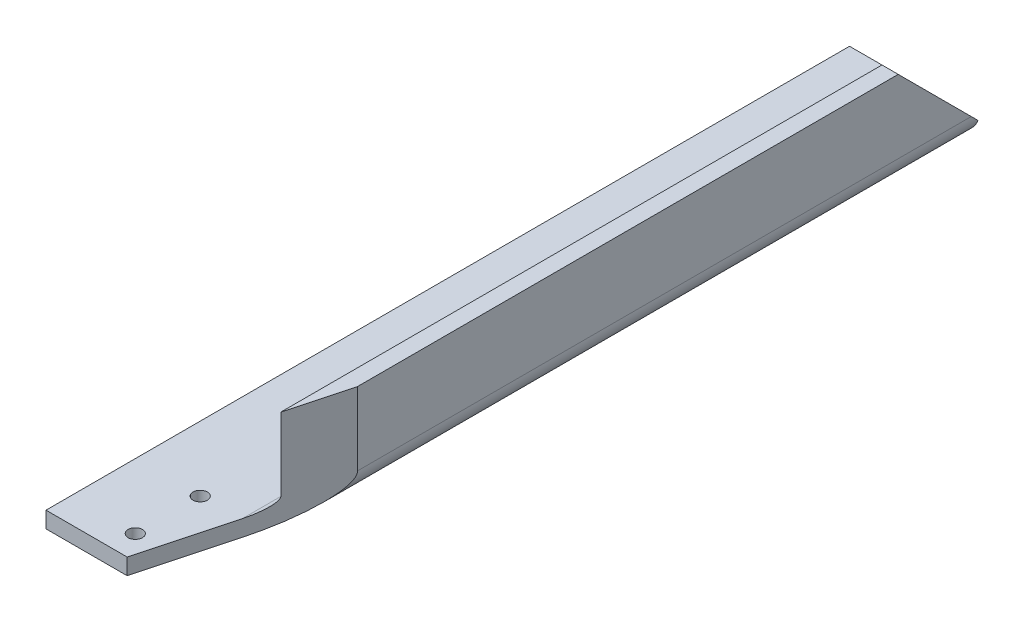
ISO-10303-21;
HEADER;
FILE_DESCRIPTION(('STEP AP214'),'2;1');
FILE_NAME('part.step','',(''),(''),'','','');
FILE_SCHEMA(('AUTOMOTIVE_DESIGN { 1 0 10303 214 1 1 1 1 }'));
ENDSEC;
DATA;
#1=APPLICATION_CONTEXT('core data for automotive mechanical design processes');
#2=APPLICATION_PROTOCOL_DEFINITION('international standard','automotive_design',2000,#1);
#3=PRODUCT_CONTEXT('',#1,'mechanical');
#4=PRODUCT('Part','Part','',(#3));
#5=PRODUCT_RELATED_PRODUCT_CATEGORY('part','',(#4));
#6=PRODUCT_DEFINITION_FORMATION('','',#4);
#7=PRODUCT_DEFINITION_CONTEXT('part definition',#1,'design');
#8=PRODUCT_DEFINITION('design','',#6,#7);
#9=PRODUCT_DEFINITION_SHAPE('','',#8);
#10=(LENGTH_UNIT() NAMED_UNIT(*) SI_UNIT(.MILLI.,.METRE.));
#11=(NAMED_UNIT(*) PLANE_ANGLE_UNIT() SI_UNIT($,.RADIAN.));
#12=(NAMED_UNIT(*) SI_UNIT($,.STERADIAN.) SOLID_ANGLE_UNIT());
#13=UNCERTAINTY_MEASURE_WITH_UNIT(LENGTH_MEASURE(1.E-05),#10,'distance_accuracy_value','');
#14=(GEOMETRIC_REPRESENTATION_CONTEXT(3) GLOBAL_UNCERTAINTY_ASSIGNED_CONTEXT((#13)) GLOBAL_UNIT_ASSIGNED_CONTEXT((#10,
#11,#12)) REPRESENTATION_CONTEXT('',''));
#15=CARTESIAN_POINT('',(0.,0.,0.));
#16=DIRECTION('',(0.,0.,1.));
#17=DIRECTION('',(1.,0.,0.));
#18=AXIS2_PLACEMENT_3D('',#15,#16,#17);
#19=CARTESIAN_POINT('',(-25.3999999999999,0.,314.325));
#20=DIRECTION('',(1.,0.,0.));
#21=DIRECTION('',(0.,1.,0.));
#22=AXIS2_PLACEMENT_3D('',#19,#20,#21);
#23=PLANE('',#22);
#24=DIRECTION('',(0.,1.,0.));
#25=VECTOR('',#24,1.);
#26=CARTESIAN_POINT('',(-25.4,6.35000000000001,38.1000000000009));
#27=LINE('',#26,#25);
#28=CARTESIAN_POINT('',(-25.4,0.,38.1000000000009));
#29=VERTEX_POINT('',#28);
#30=CARTESIAN_POINT('',(-25.4,6.35000000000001,38.1000000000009));
#31=VERTEX_POINT('',#30);
#32=EDGE_CURVE('E235',#29,#31,#27,.T.);
#33=ORIENTED_EDGE('',*,*,#32,.F.);
#34=DIRECTION('',(0.,0.,-1.));
#35=VECTOR('',#34,1.);
#36=CARTESIAN_POINT('',(-25.3999999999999,0.,314.325));
#37=LINE('',#36,#35);
#38=CARTESIAN_POINT('',(-25.3999999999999,0.,314.325));
#39=VERTEX_POINT('',#38);
#40=EDGE_CURVE('E146',#39,#29,#37,.T.);
#41=ORIENTED_EDGE('',*,*,#40,.F.);
#42=DIRECTION('',(0.,-1.,0.));
#43=VECTOR('',#42,1.);
#44=CARTESIAN_POINT('',(-25.3999999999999,0.,314.325));
#45=LINE('',#44,#43);
#46=CARTESIAN_POINT('',(-25.3999999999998,6.35000000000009,314.325));
#47=VERTEX_POINT('',#46);
#48=EDGE_CURVE('E210',#47,#39,#45,.T.);
#49=ORIENTED_EDGE('',*,*,#48,.F.);
#50=DIRECTION('',(0.,0.,-1.));
#51=VECTOR('',#50,1.);
#52=CARTESIAN_POINT('',(-25.3999999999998,6.35000000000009,314.325));
#53=LINE('',#52,#51);
#54=EDGE_CURVE('E149',#47,#31,#53,.T.);
#55=ORIENTED_EDGE('',*,*,#54,.T.);
#56=EDGE_LOOP('',(#33,#41,#49,#55));
#57=FACE_BOUND('',#56,.T.);
#58=ADVANCED_FACE('F32',(#57),#23,.F.);
#59=CARTESIAN_POINT('',(15.8750000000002,1.11022302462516E-13,314.325000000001));
#60=DIRECTION('',(0.,1.,0.));
#61=DIRECTION('',(0.,0.,1.));
#62=AXIS2_PLACEMENT_3D('',#59,#60,#61);
#63=PLANE('',#62);
#64=CARTESIAN_POINT('',(-6.34999999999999,0.,22.6314000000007));
#65=DIRECTION('',(0.,1.,0.));
#66=DIRECTION('',(0.,0.,1.));
#67=AXIS2_PLACEMENT_3D('',#64,#65,#66);
#68=CIRCLE('',#67,2.286);
#69=CARTESIAN_POINT('',(-6.34999999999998,0.,24.917400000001));
#70=VERTEX_POINT('',#69);
#71=EDGE_CURVE('E154',#70,#70,#68,.T.);
#72=ORIENTED_EDGE('',*,*,#71,.T.);
#73=EDGE_LOOP('',(#72));
#74=FACE_BOUND('',#73,.T.);
#75=CARTESIAN_POINT('',(6.35000000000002,0.,22.6314000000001));
#76=DIRECTION('',(0.,1.,0.));
#77=DIRECTION('',(0.,0.,1.));
#78=AXIS2_PLACEMENT_3D('',#75,#76,#77);
#79=CIRCLE('',#78,2.286);
#80=CARTESIAN_POINT('',(6.35000000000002,0.,24.9174000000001));
#81=VERTEX_POINT('',#80);
#82=EDGE_CURVE('E159',#81,#81,#79,.T.);
#83=ORIENTED_EDGE('',*,*,#82,.T.);
#84=EDGE_LOOP('',(#83));
#85=FACE_BOUND('',#84,.T.);
#86=CARTESIAN_POINT('',(6.35000000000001,0.,5.15620000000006));
#87=DIRECTION('',(0.,1.,0.));
#88=DIRECTION('',(0.,0.,1.));
#89=AXIS2_PLACEMENT_3D('',#86,#87,#88);
#90=CIRCLE('',#89,2.286);
#91=CARTESIAN_POINT('',(6.35000000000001,0.,7.44220000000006));
#92=VERTEX_POINT('',#91);
#93=EDGE_CURVE('E163',#92,#92,#90,.T.);
#94=ORIENTED_EDGE('',*,*,#93,.T.);
#95=EDGE_LOOP('',(#94));
#96=FACE_BOUND('',#95,.T.);
#97=CARTESIAN_POINT('',(-6.35,0.,5.15620000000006));
#98=DIRECTION('',(0.,1.,0.));
#99=DIRECTION('',(0.,0.,1.));
#100=AXIS2_PLACEMENT_3D('',#97,#98,#99);
#101=CIRCLE('',#100,2.286);
#102=CARTESIAN_POINT('',(-6.35,0.,7.44220000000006));
#103=VERTEX_POINT('',#102);
#104=EDGE_CURVE('E167',#103,#103,#101,.T.);
#105=ORIENTED_EDGE('',*,*,#104,.T.);
#106=EDGE_LOOP('',(#105));
#107=FACE_BOUND('',#106,.T.);
#108=CARTESIAN_POINT('',(1.66533453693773E-13,0.,304.8));
#109=DIRECTION('',(0.,1.,0.));
#110=DIRECTION('',(0.,0.,1.));
#111=AXIS2_PLACEMENT_3D('',#108,#109,#110);
#112=CIRCLE('',#111,2.794);
#113=CARTESIAN_POINT('',(1.69002240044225E-13,0.,307.594));
#114=VERTEX_POINT('',#113);
#115=EDGE_CURVE('E171',#114,#114,#112,.T.);
#116=ORIENTED_EDGE('',*,*,#115,.T.);
#117=EDGE_LOOP('',(#116));
#118=FACE_BOUND('',#117,.T.);
#119=CARTESIAN_POINT('',(1.52655665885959E-13,1.11022302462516E-13,279.4));
#120=DIRECTION('',(0.,1.,0.));
#121=DIRECTION('',(0.,0.,1.));
#122=AXIS2_PLACEMENT_3D('',#119,#120,#121);
#123=CIRCLE('',#122,2.794);
#124=CARTESIAN_POINT('',(1.55124452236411E-13,1.04083408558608E-13,282.194));
#125=VERTEX_POINT('',#124);
#126=EDGE_CURVE('E174',#125,#125,#123,.T.);
#127=ORIENTED_EDGE('',*,*,#126,.T.);
#128=EDGE_LOOP('',(#127));
#129=FACE_BOUND('',#128,.T.);
#130=DIRECTION('',(0.,0.,-1.));
#131=VECTOR('',#130,1.);
#132=CARTESIAN_POINT('',(-19.05,0.,38.1000000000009));
#133=LINE('',#132,#131);
#134=CARTESIAN_POINT('',(-19.05,0.,38.1000000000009));
#135=VERTEX_POINT('',#134);
#136=CARTESIAN_POINT('',(-19.05,0.,8.88178419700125E-13));
#137=VERTEX_POINT('',#136);
#138=EDGE_CURVE('E238',#135,#137,#133,.T.);
#139=ORIENTED_EDGE('',*,*,#138,.T.);
#140=DIRECTION('',(1.,0.,0.));
#141=VECTOR('',#140,1.);
#142=CARTESIAN_POINT('',(15.875,0.,8.88178419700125E-13));
#143=LINE('',#142,#141);
#144=CARTESIAN_POINT('',(15.875,0.,8.88178419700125E-13));
#145=VERTEX_POINT('',#144);
#146=EDGE_CURVE('E203',#137,#145,#143,.T.);
#147=ORIENTED_EDGE('',*,*,#146,.T.);
#148=DIRECTION('',(0.,0.,-1.));
#149=VECTOR('',#148,1.);
#150=CARTESIAN_POINT('',(15.8750000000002,1.11022302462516E-13,314.325000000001));
#151=LINE('',#150,#149);
#152=CARTESIAN_POINT('',(15.8750000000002,0.,278.777216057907));
#153=VERTEX_POINT('',#152);
#154=EDGE_CURVE('E138',#153,#145,#151,.T.);
#155=ORIENTED_EDGE('',*,*,#154,.F.);
#156=DIRECTION('',(-0.258819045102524,0.,0.965925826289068));
#157=VECTOR('',#156,1.);
#158=CARTESIAN_POINT('',(6.98805401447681,0.,311.94375));
#159=LINE('',#158,#157);
#160=CARTESIAN_POINT('',(6.35000000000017,0.,314.325));
#161=VERTEX_POINT('',#160);
#162=EDGE_CURVE('E186',#153,#161,#159,.T.);
#163=ORIENTED_EDGE('',*,*,#162,.T.);
#164=DIRECTION('',(1.,0.,0.));
#165=VECTOR('',#164,1.);
#166=CARTESIAN_POINT('',(15.8750000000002,1.11022302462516E-13,314.325000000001));
#167=LINE('',#166,#165);
#168=EDGE_CURVE('E212',#39,#161,#167,.T.);
#169=ORIENTED_EDGE('',*,*,#168,.F.);
#170=ORIENTED_EDGE('',*,*,#40,.T.);
#171=DIRECTION('',(-1.,0.,0.));
#172=VECTOR('',#171,1.);
#173=CARTESIAN_POINT('',(-25.4,0.,38.1000000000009));
#174=LINE('',#173,#172);
#175=EDGE_CURVE('E233',#135,#29,#174,.T.);
#176=ORIENTED_EDGE('',*,*,#175,.F.);
#177=EDGE_LOOP('',(#139,#147,#155,#163,#169,#170,#176));
#178=FACE_BOUND('',#177,.T.);
#179=ADVANCED_FACE('F253',(#74,#85,#96,#107,#118,#129,#178),#63,.F.);
#180=CARTESIAN_POINT('',(15.8750000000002,9.5250000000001,314.325000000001));
#181=DIRECTION('',(0.,0.,-1.));
#182=DIRECTION('',(-1.,0.,0.));
#183=AXIS2_PLACEMENT_3D('',#180,#181,#182);
#184=CYLINDRICAL_SURFACE('',#183,3.175);
#185=DIRECTION('',(0.,0.,-1.));
#186=VECTOR('',#185,1.);
#187=CARTESIAN_POINT('',(19.0500000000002,9.52500000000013,314.325));
#188=LINE('',#187,#186);
#189=CARTESIAN_POINT('',(19.0500000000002,9.52500000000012,266.927954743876));
#190=VERTEX_POINT('',#189);
#191=CARTESIAN_POINT('',(19.05,9.52500000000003,3.17499999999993));
#192=VERTEX_POINT('',#191);
#193=EDGE_CURVE('E140',#190,#192,#188,.T.);
#194=ORIENTED_EDGE('',*,*,#193,.T.);
#195=CARTESIAN_POINT('',(15.875,9.52500000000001,3.17499999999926));
#196=DIRECTION('',(0.,-0.707106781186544,0.707106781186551));
#197=DIRECTION('',(0.,-0.707106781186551,-0.707106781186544));
#198=AXIS2_PLACEMENT_3D('',#195,#196,#197);
#199=ELLIPSE('',#198,4.49012806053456,3.175);
#200=CARTESIAN_POINT('',(15.875,6.35000000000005,8.88178419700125E-13));
#201=VERTEX_POINT('',#200);
#202=EDGE_CURVE('E218',#192,#201,#199,.F.);
#203=ORIENTED_EDGE('',*,*,#202,.T.);
#204=DIRECTION('',(0.,0.,-1.));
#205=VECTOR('',#204,1.);
#206=CARTESIAN_POINT('',(15.8750000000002,6.35000000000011,314.325000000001));
#207=LINE('',#206,#205);
#208=CARTESIAN_POINT('',(15.8750000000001,6.35000000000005,278.777216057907));
#209=VERTEX_POINT('',#208);
#210=EDGE_CURVE('E40',#209,#201,#207,.T.);
#211=ORIENTED_EDGE('',*,*,#210,.F.);
#212=CARTESIAN_POINT('',(15.8750000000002,9.52500000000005,278.777216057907));
#213=DIRECTION('',(-0.965925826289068,0.,-0.258819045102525));
#214=DIRECTION('',(0.258819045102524,0.,-0.965925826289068));
#215=AXIS2_PLACEMENT_3D('',#212,#213,#214);
#216=ELLIPSE('',#215,12.267257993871,3.175);
#217=EDGE_CURVE('E180',#209,#190,#216,.F.);
#218=ORIENTED_EDGE('',*,*,#217,.T.);
#219=EDGE_LOOP('',(#194,#203,#211,#218));
#220=FACE_BOUND('',#219,.T.);
#221=ADVANCED_FACE('F34',(#220),#184,.F.);
#222=CARTESIAN_POINT('',(15.8750000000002,6.35000000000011,314.325000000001));
#223=DIRECTION('',(0.,-1.,0.));
#224=DIRECTION('',(0.,0.,-1.));
#225=AXIS2_PLACEMENT_3D('',#222,#223,#224);
#226=PLANE('',#225);
#227=CARTESIAN_POINT('',(1.54390389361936E-13,6.35000000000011,279.4));
#228=DIRECTION('',(0.,-1.,0.));
#229=DIRECTION('',(0.,0.,-1.));
#230=AXIS2_PLACEMENT_3D('',#227,#228,#229);
#231=CIRCLE('',#230,2.794);
#232=CARTESIAN_POINT('',(1.55315768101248E-13,6.3500000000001,282.194));
#233=VERTEX_POINT('',#232);
#234=EDGE_CURVE('E173',#233,#233,#231,.T.);
#235=ORIENTED_EDGE('',*,*,#234,.T.);
#236=EDGE_LOOP('',(#235));
#237=FACE_BOUND('',#236,.T.);
#238=CARTESIAN_POINT('',(1.71737624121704E-13,6.35000000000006,304.800000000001));
#239=DIRECTION('',(0.,-1.,0.));
#240=DIRECTION('',(0.,0.,-1.));
#241=AXIS2_PLACEMENT_3D('',#238,#239,#240);
#242=CIRCLE('',#241,2.794);
#243=CARTESIAN_POINT('',(1.69193555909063E-13,6.35000000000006,307.594));
#244=VERTEX_POINT('',#243);
#245=EDGE_CURVE('E170',#244,#244,#242,.T.);
#246=ORIENTED_EDGE('',*,*,#245,.T.);
#247=EDGE_LOOP('',(#246));
#248=FACE_BOUND('',#247,.T.);
#249=CARTESIAN_POINT('',(-6.35,6.35000000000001,5.15620000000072));
#250=DIRECTION('',(0.,-1.,0.));
#251=DIRECTION('',(0.,0.,-1.));
#252=AXIS2_PLACEMENT_3D('',#249,#250,#251);
#253=CIRCLE('',#252,2.286);
#254=CARTESIAN_POINT('',(-6.35,6.35,7.44220000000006));
#255=VERTEX_POINT('',#254);
#256=EDGE_CURVE('E166',#255,#255,#253,.T.);
#257=ORIENTED_EDGE('',*,*,#256,.T.);
#258=EDGE_LOOP('',(#257));
#259=FACE_BOUND('',#258,.T.);
#260=CARTESIAN_POINT('',(6.35000000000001,6.34999999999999,5.15620000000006));
#261=DIRECTION('',(0.,-1.,0.));
#262=DIRECTION('',(0.,0.,-1.));
#263=AXIS2_PLACEMENT_3D('',#260,#261,#262);
#264=CIRCLE('',#263,2.286);
#265=CARTESIAN_POINT('',(6.35000000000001,6.34999999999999,7.44220000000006));
#266=VERTEX_POINT('',#265);
#267=EDGE_CURVE('E162',#266,#266,#264,.T.);
#268=ORIENTED_EDGE('',*,*,#267,.T.);
#269=EDGE_LOOP('',(#268));
#270=FACE_BOUND('',#269,.T.);
#271=CARTESIAN_POINT('',(6.35000000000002,6.35000000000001,22.6314000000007));
#272=DIRECTION('',(0.,-1.,0.));
#273=DIRECTION('',(0.,0.,-1.));
#274=AXIS2_PLACEMENT_3D('',#271,#272,#273);
#275=CIRCLE('',#274,2.286);
#276=CARTESIAN_POINT('',(6.35000000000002,6.35,24.9174000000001));
#277=VERTEX_POINT('',#276);
#278=EDGE_CURVE('E158',#277,#277,#275,.T.);
#279=ORIENTED_EDGE('',*,*,#278,.T.);
#280=EDGE_LOOP('',(#279));
#281=FACE_BOUND('',#280,.T.);
#282=CARTESIAN_POINT('',(-6.34999999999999,6.35000000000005,22.631400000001));
#283=DIRECTION('',(0.,-1.,0.));
#284=DIRECTION('',(0.,0.,-1.));
#285=AXIS2_PLACEMENT_3D('',#282,#283,#284);
#286=CIRCLE('',#285,2.286);
#287=CARTESIAN_POINT('',(-6.34999999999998,6.35000000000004,24.917400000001));
#288=VERTEX_POINT('',#287);
#289=EDGE_CURVE('E157',#288,#288,#286,.T.);
#290=ORIENTED_EDGE('',*,*,#289,.T.);
#291=EDGE_LOOP('',(#290));
#292=FACE_BOUND('',#291,.T.);
#293=DIRECTION('',(-1.,0.,0.));
#294=VECTOR('',#293,1.);
#295=CARTESIAN_POINT('',(15.8750000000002,6.35000000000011,314.325000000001));
#296=LINE('',#295,#294);
#297=CARTESIAN_POINT('',(6.35000000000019,6.35000000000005,314.325000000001));
#298=VERTEX_POINT('',#297);
#299=EDGE_CURVE('E208',#298,#47,#296,.T.);
#300=ORIENTED_EDGE('',*,*,#299,.F.);
#301=DIRECTION('',(0.258819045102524,0.,-0.965925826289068));
#302=VECTOR('',#301,1.);
#303=CARTESIAN_POINT('',(6.98805401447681,6.35000000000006,311.94375));
#304=LINE('',#303,#302);
#305=EDGE_CURVE('E55',#298,#209,#304,.T.);
#306=ORIENTED_EDGE('',*,*,#305,.T.);
#307=ORIENTED_EDGE('',*,*,#210,.T.);
#308=DIRECTION('',(-1.,0.,0.));
#309=VECTOR('',#308,1.);
#310=CARTESIAN_POINT('',(15.875,6.35000000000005,8.88178419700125E-13));
#311=LINE('',#310,#309);
#312=CARTESIAN_POINT('',(-25.4,6.35000000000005,0.));
#313=VERTEX_POINT('',#312);
#314=EDGE_CURVE('E200',#201,#313,#311,.T.);
#315=ORIENTED_EDGE('',*,*,#314,.T.);
#316=DIRECTION('',(0.,0.,-1.));
#317=VECTOR('',#316,1.);
#318=CARTESIAN_POINT('',(-25.4,6.35000000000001,38.1000000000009));
#319=LINE('',#318,#317);
#320=EDGE_CURVE('E239',#31,#313,#319,.T.);
#321=ORIENTED_EDGE('',*,*,#320,.F.);
#322=ORIENTED_EDGE('',*,*,#54,.F.);
#323=EDGE_LOOP('',(#300,#306,#307,#315,#321,#322));
#324=FACE_BOUND('',#323,.T.);
#325=ADVANCED_FACE('F273',(#237,#248,#259,#270,#281,#292,#324),#226,.F.);
#326=CARTESIAN_POINT('',(15.8750000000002,9.5250000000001,314.325000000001));
#327=DIRECTION('',(0.,0.,-1.));
#328=DIRECTION('',(-1.,0.,0.));
#329=AXIS2_PLACEMENT_3D('',#326,#327,#328);
#330=CYLINDRICAL_SURFACE('',#329,9.525);
#331=CARTESIAN_POINT('',(15.875,9.52500000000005,0.));
#332=DIRECTION('',(0.,0.,1.));
#333=DIRECTION('',(-1.,0.,0.));
#334=AXIS2_PLACEMENT_3D('',#331,#332,#333);
#335=CIRCLE('',#334,9.525);
#336=CARTESIAN_POINT('',(24.8552561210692,6.34999999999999,8.88178419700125E-13));
#337=VERTEX_POINT('',#336);
#338=EDGE_CURVE('E205',#145,#337,#335,.T.);
#339=ORIENTED_EDGE('',*,*,#338,.T.);
#340=CARTESIAN_POINT('',(15.875,9.52500000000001,3.17499999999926));
#341=DIRECTION('',(0.,-0.707106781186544,0.707106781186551));
#342=DIRECTION('',(0.,-0.707106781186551,-0.707106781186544));
#343=AXIS2_PLACEMENT_3D('',#340,#341,#342);
#344=ELLIPSE('',#343,13.4703841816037,9.525);
#345=CARTESIAN_POINT('',(25.4,9.52500000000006,3.17499999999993));
#346=VERTEX_POINT('',#345);
#347=EDGE_CURVE('E47',#337,#346,#344,.T.);
#348=ORIENTED_EDGE('',*,*,#347,.T.);
#349=DIRECTION('',(0.,0.,-1.));
#350=VECTOR('',#349,1.);
#351=CARTESIAN_POINT('',(25.4000000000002,9.52500000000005,314.325));
#352=LINE('',#351,#350);
#353=CARTESIAN_POINT('',(25.4000000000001,9.52500000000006,243.229432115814));
#354=VERTEX_POINT('',#353);
#355=EDGE_CURVE('E131',#354,#346,#352,.T.);
#356=ORIENTED_EDGE('',*,*,#355,.F.);
#357=CARTESIAN_POINT('',(15.8750000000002,9.52500000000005,278.777216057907));
#358=DIRECTION('',(-0.965925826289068,0.,-0.258819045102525));
#359=DIRECTION('',(0.258819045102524,0.,-0.965925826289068));
#360=AXIS2_PLACEMENT_3D('',#357,#358,#359);
#361=ELLIPSE('',#360,36.801773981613,9.525);
#362=EDGE_CURVE('E247',#354,#153,#361,.T.);
#363=ORIENTED_EDGE('',*,*,#362,.T.);
#364=ORIENTED_EDGE('',*,*,#154,.T.);
#365=EDGE_LOOP('',(#339,#348,#356,#363,#364));
#366=FACE_BOUND('',#365,.T.);
#367=ADVANCED_FACE('F275',(#366),#330,.T.);
#368=CARTESIAN_POINT('',(25.4000000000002,38.1000000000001,314.325));
#369=DIRECTION('',(-1.,0.,0.));
#370=DIRECTION('',(0.,-1.,0.));
#371=AXIS2_PLACEMENT_3D('',#368,#369,#370);
#372=PLANE('',#371);
#373=ORIENTED_EDGE('',*,*,#355,.T.);
#374=DIRECTION('',(0.,-0.707106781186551,-0.707106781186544));
#375=VECTOR('',#374,1.);
#376=CARTESIAN_POINT('',(25.4,6.34999999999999,0.));
#377=LINE('',#376,#375);
#378=CARTESIAN_POINT('',(25.4,38.1,31.7500000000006));
#379=VERTEX_POINT('',#378);
#380=EDGE_CURVE('E115',#379,#346,#377,.T.);
#381=ORIENTED_EDGE('',*,*,#380,.F.);
#382=DIRECTION('',(0.,0.,-1.));
#383=VECTOR('',#382,1.);
#384=CARTESIAN_POINT('',(25.4000000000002,38.1000000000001,314.325));
#385=LINE('',#384,#383);
#386=CARTESIAN_POINT('',(25.4000000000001,38.1000000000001,243.229432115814));
#387=VERTEX_POINT('',#386);
#388=EDGE_CURVE('E129',#387,#379,#385,.T.);
#389=ORIENTED_EDGE('',*,*,#388,.F.);
#390=DIRECTION('',(0.,-1.,0.));
#391=VECTOR('',#390,1.);
#392=CARTESIAN_POINT('',(25.4000000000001,38.1000000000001,243.229432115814));
#393=LINE('',#392,#391);
#394=EDGE_CURVE('E245',#387,#354,#393,.T.);
#395=ORIENTED_EDGE('',*,*,#394,.T.);
#396=EDGE_LOOP('',(#373,#381,#389,#395));
#397=FACE_BOUND('',#396,.T.);
#398=ADVANCED_FACE('F127',(#397),#372,.F.);
#399=CARTESIAN_POINT('',(19.0500000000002,38.1000000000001,314.325));
#400=DIRECTION('',(0.,-1.,0.));
#401=DIRECTION('',(0.,0.,-1.));
#402=AXIS2_PLACEMENT_3D('',#399,#400,#401);
#403=PLANE('',#402);
#404=ORIENTED_EDGE('',*,*,#388,.T.);
#405=DIRECTION('',(1.,0.,0.));
#406=VECTOR('',#405,1.);
#407=CARTESIAN_POINT('',(-25.4,38.1,31.7500000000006));
#408=LINE('',#407,#406);
#409=CARTESIAN_POINT('',(19.05,38.1,31.7499999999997));
#410=VERTEX_POINT('',#409);
#411=EDGE_CURVE('E112',#410,#379,#408,.T.);
#412=ORIENTED_EDGE('',*,*,#411,.F.);
#413=DIRECTION('',(0.,0.,-1.));
#414=VECTOR('',#413,1.);
#415=CARTESIAN_POINT('',(19.0500000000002,38.1000000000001,314.325));
#416=LINE('',#415,#414);
#417=CARTESIAN_POINT('',(19.0500000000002,38.1000000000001,266.927954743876));
#418=VERTEX_POINT('',#417);
#419=EDGE_CURVE('E136',#418,#410,#416,.T.);
#420=ORIENTED_EDGE('',*,*,#419,.F.);
#421=DIRECTION('',(0.258819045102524,0.,-0.965925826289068));
#422=VECTOR('',#421,1.);
#423=CARTESIAN_POINT('',(7.20073868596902,38.1000000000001,311.15));
#424=LINE('',#423,#422);
#425=EDGE_CURVE('E135',#418,#387,#424,.T.);
#426=ORIENTED_EDGE('',*,*,#425,.T.);
#427=EDGE_LOOP('',(#404,#412,#420,#426));
#428=FACE_BOUND('',#427,.T.);
#429=ADVANCED_FACE('F134',(#428),#403,.F.);
#430=CARTESIAN_POINT('',(19.0500000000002,9.52500000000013,314.325));
#431=DIRECTION('',(1.,0.,0.));
#432=DIRECTION('',(0.,0.,-1.));
#433=AXIS2_PLACEMENT_3D('',#430,#431,#432);
#434=PLANE('',#433);
#435=ORIENTED_EDGE('',*,*,#419,.T.);
#436=DIRECTION('',(0.,-0.707106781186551,-0.707106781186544));
#437=VECTOR('',#436,1.);
#438=CARTESIAN_POINT('',(19.0500000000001,165.1,158.749999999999));
#439=LINE('',#438,#437);
#440=EDGE_CURVE('E117',#410,#192,#439,.T.);
#441=ORIENTED_EDGE('',*,*,#440,.T.);
#442=ORIENTED_EDGE('',*,*,#193,.F.);
#443=DIRECTION('',(0.,1.,0.));
#444=VECTOR('',#443,1.);
#445=CARTESIAN_POINT('',(19.0500000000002,9.52500000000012,266.927954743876));
#446=LINE('',#445,#444);
#447=EDGE_CURVE('E222',#190,#418,#446,.T.);
#448=ORIENTED_EDGE('',*,*,#447,.T.);
#449=EDGE_LOOP('',(#435,#441,#442,#448));
#450=FACE_BOUND('',#449,.T.);
#451=ADVANCED_FACE('F221',(#450),#434,.F.);
#452=CARTESIAN_POINT('',(15.8750000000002,9.5250000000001,314.325000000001));
#453=DIRECTION('',(0.,0.,-1.));
#454=DIRECTION('',(-1.,0.,0.));
#455=AXIS2_PLACEMENT_3D('',#452,#453,#454);
#456=PLANE('',#455);
#457=ORIENTED_EDGE('',*,*,#168,.T.);
#458=DIRECTION('',(0.,1.,0.));
#459=VECTOR('',#458,1.);
#460=CARTESIAN_POINT('',(6.35000000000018,9.52500000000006,314.325000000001));
#461=LINE('',#460,#459);
#462=EDGE_CURVE('E11',#161,#298,#461,.T.);
#463=ORIENTED_EDGE('',*,*,#462,.T.);
#464=ORIENTED_EDGE('',*,*,#299,.T.);
#465=ORIENTED_EDGE('',*,*,#48,.T.);
#466=EDGE_LOOP('',(#457,#463,#464,#465));
#467=FACE_BOUND('',#466,.T.);
#468=ADVANCED_FACE('F255',(#467),#456,.F.);
#469=CARTESIAN_POINT('',(15.875,9.52500000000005,0.));
#470=DIRECTION('',(0.,0.,-1.));
#471=DIRECTION('',(-1.,0.,0.));
#472=AXIS2_PLACEMENT_3D('',#469,#470,#471);
#473=PLANE('',#472);
#474=DIRECTION('',(1.,0.,0.));
#475=VECTOR('',#474,1.);
#476=CARTESIAN_POINT('',(-25.4,6.35000000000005,0.));
#477=LINE('',#476,#475);
#478=EDGE_CURVE('E122',#201,#337,#477,.T.);
#479=ORIENTED_EDGE('',*,*,#478,.T.);
#480=ORIENTED_EDGE('',*,*,#338,.F.);
#481=ORIENTED_EDGE('',*,*,#146,.F.);
#482=CARTESIAN_POINT('',(-19.05,6.34999999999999,8.88178419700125E-13));
#483=DIRECTION('',(0.,0.,1.));
#484=DIRECTION('',(-1.,0.,0.));
#485=AXIS2_PLACEMENT_3D('',#482,#483,#484);
#486=CIRCLE('',#485,6.35);
#487=EDGE_CURVE('E228',#313,#137,#486,.T.);
#488=ORIENTED_EDGE('',*,*,#487,.F.);
#489=ORIENTED_EDGE('',*,*,#314,.F.);
#490=EDGE_LOOP('',(#479,#480,#481,#488,#489));
#491=FACE_BOUND('',#490,.T.);
#492=ADVANCED_FACE('F271',(#491),#473,.T.);
#493=CARTESIAN_POINT('',(-6.34999999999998,-31.75,22.631400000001));
#494=DIRECTION('',(0.,1.,0.));
#495=DIRECTION('',(0.,0.,1.));
#496=AXIS2_PLACEMENT_3D('',#493,#494,#495);
#497=CYLINDRICAL_SURFACE('',#496,2.286);
#498=CARTESIAN_POINT('',(-6.34999999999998,0.,24.917400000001));
#499=CARTESIAN_POINT('',(-6.34999999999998,0.0661458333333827,24.917400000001));
#500=CARTESIAN_POINT('',(-6.34999999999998,0.132291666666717,24.917400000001));
#501=CARTESIAN_POINT('',(-6.34999999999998,0.264583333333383,24.917400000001));
#502=CARTESIAN_POINT('',(-6.34999999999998,0.330729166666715,24.917400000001));
#503=CARTESIAN_POINT('',(-6.34999999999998,0.463020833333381,24.917400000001));
#504=CARTESIAN_POINT('',(-6.34999999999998,0.529166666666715,24.917400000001));
#505=CARTESIAN_POINT('',(-6.34999999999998,0.661458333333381,24.917400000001));
#506=CARTESIAN_POINT('',(-6.34999999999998,0.727604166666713,24.917400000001));
#507=CARTESIAN_POINT('',(-6.34999999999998,0.859895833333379,24.917400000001));
#508=CARTESIAN_POINT('',(-6.34999999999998,0.926041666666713,24.917400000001));
#509=CARTESIAN_POINT('',(-6.34999999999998,1.05833333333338,24.917400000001));
#510=CARTESIAN_POINT('',(-6.34999999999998,1.12447916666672,24.917400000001));
#511=CARTESIAN_POINT('',(-6.34999999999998,1.25677083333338,24.917400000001));
#512=CARTESIAN_POINT('',(-6.34999999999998,1.32291666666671,24.917400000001));
#513=CARTESIAN_POINT('',(-6.34999999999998,1.45520833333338,24.917400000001));
#514=CARTESIAN_POINT('',(-6.34999999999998,1.52135416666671,24.917400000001));
#515=CARTESIAN_POINT('',(-6.34999999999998,1.65364583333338,24.917400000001));
#516=CARTESIAN_POINT('',(-6.34999999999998,1.71979166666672,24.917400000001));
#517=CARTESIAN_POINT('',(-6.34999999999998,1.85208333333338,24.917400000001));
#518=CARTESIAN_POINT('',(-6.34999999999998,1.91822916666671,24.917400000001));
#519=CARTESIAN_POINT('',(-6.34999999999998,2.05052083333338,24.917400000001));
#520=CARTESIAN_POINT('',(-6.34999999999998,2.11666666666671,24.917400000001));
#521=CARTESIAN_POINT('',(-6.34999999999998,2.24895833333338,24.917400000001));
#522=CARTESIAN_POINT('',(-6.34999999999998,2.31510416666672,24.917400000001));
#523=CARTESIAN_POINT('',(-6.34999999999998,2.44739583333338,24.917400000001));
#524=CARTESIAN_POINT('',(-6.34999999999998,2.51354166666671,24.917400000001));
#525=CARTESIAN_POINT('',(-6.34999999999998,2.64583333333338,24.917400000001));
#526=CARTESIAN_POINT('',(-6.34999999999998,2.71197916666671,24.917400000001));
#527=CARTESIAN_POINT('',(-6.34999999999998,2.84427083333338,24.917400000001));
#528=CARTESIAN_POINT('',(-6.34999999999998,2.91041666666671,24.917400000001));
#529=CARTESIAN_POINT('',(-6.34999999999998,3.04270833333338,24.917400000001));
#530=CARTESIAN_POINT('',(-6.34999999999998,3.10885416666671,24.917400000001));
#531=CARTESIAN_POINT('',(-6.34999999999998,3.24114583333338,24.917400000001));
#532=CARTESIAN_POINT('',(-6.34999999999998,3.30729166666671,24.917400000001));
#533=CARTESIAN_POINT('',(-6.34999999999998,3.43958333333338,24.917400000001));
#534=CARTESIAN_POINT('',(-6.34999999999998,3.50572916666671,24.917400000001));
#535=CARTESIAN_POINT('',(-6.34999999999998,3.63802083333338,24.917400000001));
#536=CARTESIAN_POINT('',(-6.34999999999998,3.70416666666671,24.917400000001));
#537=CARTESIAN_POINT('',(-6.34999999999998,3.83645833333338,24.917400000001));
#538=CARTESIAN_POINT('',(-6.34999999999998,3.90260416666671,24.917400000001));
#539=CARTESIAN_POINT('',(-6.34999999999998,4.03489583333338,24.917400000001));
#540=CARTESIAN_POINT('',(-6.34999999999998,4.10104166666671,24.917400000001));
#541=CARTESIAN_POINT('',(-6.34999999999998,4.23333333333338,24.917400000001));
#542=CARTESIAN_POINT('',(-6.34999999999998,4.29947916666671,24.917400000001));
#543=CARTESIAN_POINT('',(-6.34999999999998,4.43177083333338,24.917400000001));
#544=CARTESIAN_POINT('',(-6.34999999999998,4.49791666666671,24.917400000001));
#545=CARTESIAN_POINT('',(-6.34999999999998,4.63020833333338,24.917400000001));
#546=CARTESIAN_POINT('',(-6.34999999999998,4.69635416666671,24.917400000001));
#547=CARTESIAN_POINT('',(-6.34999999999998,4.82864583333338,24.917400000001));
#548=CARTESIAN_POINT('',(-6.34999999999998,4.89479166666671,24.917400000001));
#549=CARTESIAN_POINT('',(-6.34999999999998,5.02708333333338,24.917400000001));
#550=CARTESIAN_POINT('',(-6.34999999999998,5.09322916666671,24.917400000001));
#551=CARTESIAN_POINT('',(-6.34999999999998,5.22552083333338,24.917400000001));
#552=CARTESIAN_POINT('',(-6.34999999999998,5.29166666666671,24.917400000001));
#553=CARTESIAN_POINT('',(-6.34999999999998,5.42395833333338,24.917400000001));
#554=CARTESIAN_POINT('',(-6.34999999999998,5.49010416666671,24.917400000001));
#555=CARTESIAN_POINT('',(-6.34999999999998,5.62239583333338,24.917400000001));
#556=CARTESIAN_POINT('',(-6.34999999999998,5.68854166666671,24.917400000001));
#557=CARTESIAN_POINT('',(-6.34999999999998,5.82083333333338,24.917400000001));
#558=CARTESIAN_POINT('',(-6.34999999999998,5.88697916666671,24.917400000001));
#559=CARTESIAN_POINT('',(-6.34999999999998,6.01927083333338,24.917400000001));
#560=CARTESIAN_POINT('',(-6.34999999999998,6.08541666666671,24.917400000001));
#561=CARTESIAN_POINT('',(-6.34999999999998,6.21770833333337,24.917400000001));
#562=CARTESIAN_POINT('',(-6.34999999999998,6.28385416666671,24.917400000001));
#563=CARTESIAN_POINT('',(-6.34999999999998,6.35000000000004,24.917400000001));
#564=B_SPLINE_CURVE_WITH_KNOTS('',3,(#498,#499,#500,#501,#502,#503,#504,#505,#506,#507,#508,
#509,#510,#511,#512,#513,#514,#515,#516,#517,#518,#519,#520,#521,#522,#523,#524,#525,#526,#527,
#528,#529,#530,#531,#532,#533,#534,#535,#536,#537,#538,#539,#540,#541,#542,#543,#544,#545,#546,
#547,#548,#549,#550,#551,#552,#553,#554,#555,#556,#557,#558,#559,#560,#561,#562,#563),
.UNSPECIFIED.,.F.,.F.,(4,2,2,2,2,2,2,2,2,2,2,2,2,2,2,2,2,2,2,2,2,2,2,2,2,2,2,2,2,2,2,2,4),(0.,
0.198437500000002,0.396874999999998,0.5953125,0.793749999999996,0.992187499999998,1.190625,
1.3890625,1.5875,1.7859375,1.984375,2.1828125,2.38125,2.5796875,2.778125,2.97656249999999,3.175,
3.3734375,3.571875,3.7703125,3.96874999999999,4.1671875,4.365625,4.56406249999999,4.7625,
4.9609375,5.15937499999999,5.3578125,5.55625,5.75468749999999,5.953125,6.15156249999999,
6.34999999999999),.UNSPECIFIED.);
#565=EDGE_CURVE('BSEAM302',#70,#288,#564,.T.);
#566=ORIENTED_EDGE('',*,*,#71,.F.);
#567=ORIENTED_EDGE('',*,*,#289,.F.);
#568=ORIENTED_EDGE('',*,*,#565,.T.);
#569=ORIENTED_EDGE('',*,*,#565,.F.);
#570=EDGE_LOOP('',(#566,#568,#567,#569));
#571=FACE_BOUND('',#570,.T.);
#572=ADVANCED_FACE('F302',(#571),#497,.F.);
#573=CARTESIAN_POINT('',(6.35000000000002,-31.75,22.6314000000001));
#574=DIRECTION('',(0.,1.,0.));
#575=DIRECTION('',(0.,0.,1.));
#576=AXIS2_PLACEMENT_3D('',#573,#574,#575);
#577=CYLINDRICAL_SURFACE('',#576,2.286);
#578=CARTESIAN_POINT('',(6.35000000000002,0.,24.9174000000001));
#579=CARTESIAN_POINT('',(6.35000000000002,0.0661458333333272,24.9174000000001));
#580=CARTESIAN_POINT('',(6.35000000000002,0.132291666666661,24.9174000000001));
#581=CARTESIAN_POINT('',(6.35000000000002,0.264583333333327,24.9174000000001));
#582=CARTESIAN_POINT('',(6.35000000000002,0.330729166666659,24.9174000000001));
#583=CARTESIAN_POINT('',(6.35000000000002,0.463020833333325,24.9174000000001));
#584=CARTESIAN_POINT('',(6.35000000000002,0.529166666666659,24.9174000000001));
#585=CARTESIAN_POINT('',(6.35000000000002,0.661458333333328,24.9174000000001));
#586=CARTESIAN_POINT('',(6.35000000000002,0.727604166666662,24.9174000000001));
#587=CARTESIAN_POINT('',(6.35000000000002,0.859895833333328,24.9174000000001));
#588=CARTESIAN_POINT('',(6.35000000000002,0.92604166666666,24.9174000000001));
#589=CARTESIAN_POINT('',(6.35000000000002,1.05833333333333,24.9174000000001));
#590=CARTESIAN_POINT('',(6.35000000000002,1.12447916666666,24.9174000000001));
#591=CARTESIAN_POINT('',(6.35000000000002,1.25677083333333,24.9174000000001));
#592=CARTESIAN_POINT('',(6.35000000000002,1.32291666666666,24.9174000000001));
#593=CARTESIAN_POINT('',(6.35000000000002,1.45520833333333,24.9174000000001));
#594=CARTESIAN_POINT('',(6.35000000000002,1.52135416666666,24.9174000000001));
#595=CARTESIAN_POINT('',(6.35000000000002,1.65364583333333,24.9174000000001));
#596=CARTESIAN_POINT('',(6.35000000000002,1.71979166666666,24.9174000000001));
#597=CARTESIAN_POINT('',(6.35000000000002,1.85208333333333,24.9174000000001));
#598=CARTESIAN_POINT('',(6.35000000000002,1.91822916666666,24.9174000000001));
#599=CARTESIAN_POINT('',(6.35000000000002,2.05052083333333,24.9174000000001));
#600=CARTESIAN_POINT('',(6.35000000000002,2.11666666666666,24.9174000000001));
#601=CARTESIAN_POINT('',(6.35000000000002,2.24895833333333,24.9174000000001));
#602=CARTESIAN_POINT('',(6.35000000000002,2.31510416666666,24.9174000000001));
#603=CARTESIAN_POINT('',(6.35000000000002,2.44739583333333,24.9174000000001));
#604=CARTESIAN_POINT('',(6.35000000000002,2.51354166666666,24.9174000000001));
#605=CARTESIAN_POINT('',(6.35000000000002,2.64583333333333,24.9174000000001));
#606=CARTESIAN_POINT('',(6.35000000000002,2.71197916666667,24.9174000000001));
#607=CARTESIAN_POINT('',(6.35000000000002,2.84427083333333,24.9174000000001));
#608=CARTESIAN_POINT('',(6.35000000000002,2.91041666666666,24.9174000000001));
#609=CARTESIAN_POINT('',(6.35000000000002,3.04270833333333,24.9174000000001));
#610=CARTESIAN_POINT('',(6.35000000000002,3.10885416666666,24.9174000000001));
#611=CARTESIAN_POINT('',(6.35000000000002,3.24114583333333,24.9174000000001));
#612=CARTESIAN_POINT('',(6.35000000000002,3.30729166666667,24.9174000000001));
#613=CARTESIAN_POINT('',(6.35000000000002,3.43958333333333,24.9174000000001));
#614=CARTESIAN_POINT('',(6.35000000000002,3.50572916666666,24.9174000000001));
#615=CARTESIAN_POINT('',(6.35000000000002,3.63802083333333,24.9174000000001));
#616=CARTESIAN_POINT('',(6.35000000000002,3.70416666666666,24.9174000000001));
#617=CARTESIAN_POINT('',(6.35000000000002,3.83645833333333,24.9174000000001));
#618=CARTESIAN_POINT('',(6.35000000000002,3.90260416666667,24.9174000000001));
#619=CARTESIAN_POINT('',(6.35000000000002,4.03489583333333,24.9174000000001));
#620=CARTESIAN_POINT('',(6.35000000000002,4.10104166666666,24.9174000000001));
#621=CARTESIAN_POINT('',(6.35000000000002,4.23333333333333,24.9174000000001));
#622=CARTESIAN_POINT('',(6.35000000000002,4.29947916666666,24.9174000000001));
#623=CARTESIAN_POINT('',(6.35000000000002,4.43177083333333,24.9174000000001));
#624=CARTESIAN_POINT('',(6.35000000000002,4.49791666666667,24.9174000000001));
#625=CARTESIAN_POINT('',(6.35000000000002,4.63020833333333,24.9174000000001));
#626=CARTESIAN_POINT('',(6.35000000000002,4.69635416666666,24.9174000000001));
#627=CARTESIAN_POINT('',(6.35000000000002,4.82864583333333,24.9174000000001));
#628=CARTESIAN_POINT('',(6.35000000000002,4.89479166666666,24.9174000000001));
#629=CARTESIAN_POINT('',(6.35000000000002,5.02708333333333,24.9174000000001));
#630=CARTESIAN_POINT('',(6.35000000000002,5.09322916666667,24.9174000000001));
#631=CARTESIAN_POINT('',(6.35000000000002,5.22552083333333,24.9174000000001));
#632=CARTESIAN_POINT('',(6.35000000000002,5.29166666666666,24.9174000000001));
#633=CARTESIAN_POINT('',(6.35000000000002,5.42395833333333,24.9174000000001));
#634=CARTESIAN_POINT('',(6.35000000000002,5.49010416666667,24.9174000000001));
#635=CARTESIAN_POINT('',(6.35000000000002,5.62239583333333,24.9174000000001));
#636=CARTESIAN_POINT('',(6.35000000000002,5.68854166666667,24.9174000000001));
#637=CARTESIAN_POINT('',(6.35000000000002,5.82083333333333,24.9174000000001));
#638=CARTESIAN_POINT('',(6.35000000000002,5.88697916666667,24.9174000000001));
#639=CARTESIAN_POINT('',(6.35000000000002,6.01927083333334,24.9174000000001));
#640=CARTESIAN_POINT('',(6.35000000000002,6.08541666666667,24.9174000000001));
#641=CARTESIAN_POINT('',(6.35000000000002,6.21770833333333,24.9174000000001));
#642=CARTESIAN_POINT('',(6.35000000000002,6.28385416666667,24.9174000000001));
#643=CARTESIAN_POINT('',(6.35000000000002,6.35,24.9174000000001));
#644=B_SPLINE_CURVE_WITH_KNOTS('',3,(#578,#579,#580,#581,#582,#583,#584,#585,#586,#587,#588,
#589,#590,#591,#592,#593,#594,#595,#596,#597,#598,#599,#600,#601,#602,#603,#604,#605,#606,#607,
#608,#609,#610,#611,#612,#613,#614,#615,#616,#617,#618,#619,#620,#621,#622,#623,#624,#625,#626,
#627,#628,#629,#630,#631,#632,#633,#634,#635,#636,#637,#638,#639,#640,#641,#642,#643),
.UNSPECIFIED.,.F.,.F.,(4,2,2,2,2,2,2,2,2,2,2,2,2,2,2,2,2,2,2,2,2,2,2,2,2,2,2,2,2,2,2,2,4),(0.,
0.198437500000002,0.396874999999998,0.5953125,0.793750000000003,0.992187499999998,1.190625,
1.3890625,1.58750000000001,1.7859375,1.984375,2.18281250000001,2.38125,2.5796875,
2.77812500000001,2.9765625,3.175,3.37343750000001,3.571875,3.7703125,3.96875000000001,4.1671875,
4.365625,4.56406250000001,4.7625,4.96093750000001,5.15937500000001,5.3578125,5.55625000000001,
5.75468750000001,5.95312500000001,6.15156250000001,6.35000000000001),.UNSPECIFIED.);
#645=EDGE_CURVE('BSEAM305',#81,#277,#644,.T.);
#646=ORIENTED_EDGE('',*,*,#82,.F.);
#647=ORIENTED_EDGE('',*,*,#278,.F.);
#648=ORIENTED_EDGE('',*,*,#645,.T.);
#649=ORIENTED_EDGE('',*,*,#645,.F.);
#650=EDGE_LOOP('',(#646,#648,#647,#649));
#651=FACE_BOUND('',#650,.T.);
#652=ADVANCED_FACE('F305',(#651),#577,.F.);
#653=CARTESIAN_POINT('',(6.35000000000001,-31.75,5.15620000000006));
#654=DIRECTION('',(0.,1.,0.));
#655=DIRECTION('',(0.,0.,1.));
#656=AXIS2_PLACEMENT_3D('',#653,#654,#655);
#657=CYLINDRICAL_SURFACE('',#656,2.286);
#658=CARTESIAN_POINT('',(6.35000000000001,0.,7.44220000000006));
#659=CARTESIAN_POINT('',(6.35000000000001,0.0661458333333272,7.44220000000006));
#660=CARTESIAN_POINT('',(6.35000000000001,0.132291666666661,7.44220000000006));
#661=CARTESIAN_POINT('',(6.35000000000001,0.264583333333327,7.44220000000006));
#662=CARTESIAN_POINT('',(6.35000000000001,0.330729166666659,7.44220000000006));
#663=CARTESIAN_POINT('',(6.35000000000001,0.463020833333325,7.44220000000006));
#664=CARTESIAN_POINT('',(6.35000000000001,0.529166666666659,7.44220000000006));
#665=CARTESIAN_POINT('',(6.35000000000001,0.661458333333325,7.44220000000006));
#666=CARTESIAN_POINT('',(6.35000000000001,0.727604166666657,7.44220000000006));
#667=CARTESIAN_POINT('',(6.35000000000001,0.859895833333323,7.44220000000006));
#668=CARTESIAN_POINT('',(6.35000000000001,0.926041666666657,7.44220000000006));
#669=CARTESIAN_POINT('',(6.35000000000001,1.05833333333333,7.44220000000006));
#670=CARTESIAN_POINT('',(6.35000000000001,1.12447916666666,7.44220000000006));
#671=CARTESIAN_POINT('',(6.35000000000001,1.25677083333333,7.44220000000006));
#672=CARTESIAN_POINT('',(6.35000000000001,1.32291666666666,7.44220000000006));
#673=CARTESIAN_POINT('',(6.35000000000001,1.45520833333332,7.44220000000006));
#674=CARTESIAN_POINT('',(6.35000000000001,1.52135416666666,7.44220000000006));
#675=CARTESIAN_POINT('',(6.35000000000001,1.65364583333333,7.44220000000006));
#676=CARTESIAN_POINT('',(6.35000000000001,1.71979166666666,7.44220000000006));
#677=CARTESIAN_POINT('',(6.35000000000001,1.85208333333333,7.44220000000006));
#678=CARTESIAN_POINT('',(6.35000000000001,1.91822916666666,7.44220000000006));
#679=CARTESIAN_POINT('',(6.35000000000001,2.05052083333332,7.44220000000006));
#680=CARTESIAN_POINT('',(6.35000000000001,2.11666666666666,7.44220000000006));
#681=CARTESIAN_POINT('',(6.35000000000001,2.24895833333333,7.44220000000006));
#682=CARTESIAN_POINT('',(6.35000000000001,2.31510416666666,7.44220000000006));
#683=CARTESIAN_POINT('',(6.35000000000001,2.44739583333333,7.44220000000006));
#684=CARTESIAN_POINT('',(6.35000000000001,2.51354166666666,7.44220000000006));
#685=CARTESIAN_POINT('',(6.35000000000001,2.64583333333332,7.44220000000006));
#686=CARTESIAN_POINT('',(6.35000000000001,2.71197916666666,7.44220000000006));
#687=CARTESIAN_POINT('',(6.35000000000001,2.84427083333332,7.44220000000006));
#688=CARTESIAN_POINT('',(6.35000000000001,2.91041666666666,7.44220000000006));
#689=CARTESIAN_POINT('',(6.35000000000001,3.04270833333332,7.44220000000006));
#690=CARTESIAN_POINT('',(6.35000000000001,3.10885416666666,7.44220000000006));
#691=CARTESIAN_POINT('',(6.35000000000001,3.24114583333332,7.44220000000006));
#692=CARTESIAN_POINT('',(6.35000000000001,3.30729166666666,7.44220000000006));
#693=CARTESIAN_POINT('',(6.35000000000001,3.43958333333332,7.44220000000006));
#694=CARTESIAN_POINT('',(6.35000000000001,3.50572916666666,7.44220000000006));
#695=CARTESIAN_POINT('',(6.35000000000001,3.63802083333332,7.44220000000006));
#696=CARTESIAN_POINT('',(6.35000000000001,3.70416666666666,7.44220000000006));
#697=CARTESIAN_POINT('',(6.35000000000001,3.83645833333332,7.44220000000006));
#698=CARTESIAN_POINT('',(6.35000000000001,3.90260416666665,7.44220000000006));
#699=CARTESIAN_POINT('',(6.35000000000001,4.03489583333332,7.44220000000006));
#700=CARTESIAN_POINT('',(6.35000000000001,4.10104166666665,7.44220000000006));
#701=CARTESIAN_POINT('',(6.35000000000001,4.23333333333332,7.44220000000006));
#702=CARTESIAN_POINT('',(6.35000000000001,4.29947916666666,7.44220000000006));
#703=CARTESIAN_POINT('',(6.35000000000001,4.43177083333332,7.44220000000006));
#704=CARTESIAN_POINT('',(6.35000000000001,4.49791666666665,7.44220000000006));
#705=CARTESIAN_POINT('',(6.35000000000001,4.63020833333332,7.44220000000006));
#706=CARTESIAN_POINT('',(6.35000000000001,4.69635416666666,7.44220000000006));
#707=CARTESIAN_POINT('',(6.35000000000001,4.82864583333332,7.44220000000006));
#708=CARTESIAN_POINT('',(6.35000000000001,4.89479166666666,7.44220000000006));
#709=CARTESIAN_POINT('',(6.35000000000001,5.02708333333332,7.44220000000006));
#710=CARTESIAN_POINT('',(6.35000000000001,5.09322916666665,7.44220000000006));
#711=CARTESIAN_POINT('',(6.35000000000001,5.22552083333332,7.44220000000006));
#712=CARTESIAN_POINT('',(6.35000000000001,5.29166666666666,7.44220000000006));
#713=CARTESIAN_POINT('',(6.35000000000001,5.42395833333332,7.44220000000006));
#714=CARTESIAN_POINT('',(6.35000000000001,5.49010416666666,7.44220000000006));
#715=CARTESIAN_POINT('',(6.35000000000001,5.62239583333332,7.44220000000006));
#716=CARTESIAN_POINT('',(6.35000000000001,5.68854166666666,7.44220000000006));
#717=CARTESIAN_POINT('',(6.35000000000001,5.82083333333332,7.44220000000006));
#718=CARTESIAN_POINT('',(6.35000000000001,5.88697916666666,7.44220000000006));
#719=CARTESIAN_POINT('',(6.35000000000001,6.01927083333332,7.44220000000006));
#720=CARTESIAN_POINT('',(6.35000000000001,6.08541666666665,7.44220000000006));
#721=CARTESIAN_POINT('',(6.35000000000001,6.21770833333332,7.44220000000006));
#722=CARTESIAN_POINT('',(6.35000000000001,6.28385416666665,7.44220000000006));
#723=CARTESIAN_POINT('',(6.35000000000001,6.34999999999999,7.44220000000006));
#724=B_SPLINE_CURVE_WITH_KNOTS('',3,(#658,#659,#660,#661,#662,#663,#664,#665,#666,#667,#668,
#669,#670,#671,#672,#673,#674,#675,#676,#677,#678,#679,#680,#681,#682,#683,#684,#685,#686,#687,
#688,#689,#690,#691,#692,#693,#694,#695,#696,#697,#698,#699,#700,#701,#702,#703,#704,#705,#706,
#707,#708,#709,#710,#711,#712,#713,#714,#715,#716,#717,#718,#719,#720,#721,#722,#723),
.UNSPECIFIED.,.F.,.F.,(4,2,2,2,2,2,2,2,2,2,2,2,2,2,2,2,2,2,2,2,2,2,2,2,2,2,2,2,2,2,2,2,4),(0.,
0.198437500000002,0.396874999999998,0.5953125,0.793749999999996,0.992187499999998,1.190625,
1.3890625,1.5875,1.7859375,1.984375,2.1828125,2.38125,2.5796875,2.778125,2.97656249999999,3.175,
3.3734375,3.571875,3.7703125,3.96874999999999,4.1671875,4.365625,4.56406249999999,4.7625,
4.9609375,5.15937499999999,5.3578125,5.55625,5.75468749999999,5.953125,6.15156249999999,
6.34999999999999),.UNSPECIFIED.);
#725=EDGE_CURVE('BSEAM309',#92,#266,#724,.T.);
#726=ORIENTED_EDGE('',*,*,#93,.F.);
#727=ORIENTED_EDGE('',*,*,#267,.F.);
#728=ORIENTED_EDGE('',*,*,#725,.T.);
#729=ORIENTED_EDGE('',*,*,#725,.F.);
#730=EDGE_LOOP('',(#726,#728,#727,#729));
#731=FACE_BOUND('',#730,.T.);
#732=ADVANCED_FACE('F309',(#731),#657,.F.);
#733=CARTESIAN_POINT('',(-6.35,-31.75,5.15620000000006));
#734=DIRECTION('',(0.,1.,0.));
#735=DIRECTION('',(0.,0.,1.));
#736=AXIS2_PLACEMENT_3D('',#733,#734,#735);
#737=CYLINDRICAL_SURFACE('',#736,2.286);
#738=CARTESIAN_POINT('',(-6.35,0.,7.44220000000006));
#739=CARTESIAN_POINT('',(-6.35,0.0661458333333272,7.44220000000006));
#740=CARTESIAN_POINT('',(-6.35,0.132291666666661,7.44220000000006));
#741=CARTESIAN_POINT('',(-6.35,0.264583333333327,7.44220000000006));
#742=CARTESIAN_POINT('',(-6.35,0.330729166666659,7.44220000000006));
#743=CARTESIAN_POINT('',(-6.35,0.463020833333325,7.44220000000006));
#744=CARTESIAN_POINT('',(-6.35,0.529166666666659,7.44220000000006));
#745=CARTESIAN_POINT('',(-6.35,0.661458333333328,7.44220000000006));
#746=CARTESIAN_POINT('',(-6.35,0.727604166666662,7.44220000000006));
#747=CARTESIAN_POINT('',(-6.35,0.859895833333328,7.44220000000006));
#748=CARTESIAN_POINT('',(-6.35,0.92604166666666,7.44220000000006));
#749=CARTESIAN_POINT('',(-6.35,1.05833333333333,7.44220000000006));
#750=CARTESIAN_POINT('',(-6.35,1.12447916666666,7.44220000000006));
#751=CARTESIAN_POINT('',(-6.35,1.25677083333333,7.44220000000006));
#752=CARTESIAN_POINT('',(-6.35,1.32291666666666,7.44220000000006));
#753=CARTESIAN_POINT('',(-6.35,1.45520833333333,7.44220000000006));
#754=CARTESIAN_POINT('',(-6.35,1.52135416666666,7.44220000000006));
#755=CARTESIAN_POINT('',(-6.35,1.65364583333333,7.44220000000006));
#756=CARTESIAN_POINT('',(-6.35,1.71979166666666,7.44220000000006));
#757=CARTESIAN_POINT('',(-6.35,1.85208333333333,7.44220000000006));
#758=CARTESIAN_POINT('',(-6.35,1.91822916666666,7.44220000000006));
#759=CARTESIAN_POINT('',(-6.35,2.05052083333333,7.44220000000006));
#760=CARTESIAN_POINT('',(-6.35,2.11666666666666,7.44220000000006));
#761=CARTESIAN_POINT('',(-6.35,2.24895833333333,7.44220000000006));
#762=CARTESIAN_POINT('',(-6.35,2.31510416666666,7.44220000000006));
#763=CARTESIAN_POINT('',(-6.35,2.44739583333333,7.44220000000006));
#764=CARTESIAN_POINT('',(-6.35,2.51354166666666,7.44220000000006));
#765=CARTESIAN_POINT('',(-6.35,2.64583333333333,7.44220000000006));
#766=CARTESIAN_POINT('',(-6.35,2.71197916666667,7.44220000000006));
#767=CARTESIAN_POINT('',(-6.35,2.84427083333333,7.44220000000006));
#768=CARTESIAN_POINT('',(-6.35,2.91041666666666,7.44220000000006));
#769=CARTESIAN_POINT('',(-6.35,3.04270833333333,7.44220000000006));
#770=CARTESIAN_POINT('',(-6.35,3.10885416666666,7.44220000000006));
#771=CARTESIAN_POINT('',(-6.35,3.24114583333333,7.44220000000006));
#772=CARTESIAN_POINT('',(-6.35,3.30729166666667,7.44220000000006));
#773=CARTESIAN_POINT('',(-6.35,3.43958333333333,7.44220000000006));
#774=CARTESIAN_POINT('',(-6.35,3.50572916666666,7.44220000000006));
#775=CARTESIAN_POINT('',(-6.35,3.63802083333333,7.44220000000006));
#776=CARTESIAN_POINT('',(-6.35,3.70416666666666,7.44220000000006));
#777=CARTESIAN_POINT('',(-6.35,3.83645833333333,7.44220000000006));
#778=CARTESIAN_POINT('',(-6.35,3.90260416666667,7.44220000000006));
#779=CARTESIAN_POINT('',(-6.35,4.03489583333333,7.44220000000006));
#780=CARTESIAN_POINT('',(-6.35,4.10104166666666,7.44220000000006));
#781=CARTESIAN_POINT('',(-6.35,4.23333333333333,7.44220000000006));
#782=CARTESIAN_POINT('',(-6.35,4.29947916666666,7.44220000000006));
#783=CARTESIAN_POINT('',(-6.35,4.43177083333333,7.44220000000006));
#784=CARTESIAN_POINT('',(-6.35,4.49791666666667,7.44220000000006));
#785=CARTESIAN_POINT('',(-6.35,4.63020833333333,7.44220000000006));
#786=CARTESIAN_POINT('',(-6.35,4.69635416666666,7.44220000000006));
#787=CARTESIAN_POINT('',(-6.35,4.82864583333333,7.44220000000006));
#788=CARTESIAN_POINT('',(-6.35,4.89479166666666,7.44220000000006));
#789=CARTESIAN_POINT('',(-6.35,5.02708333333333,7.44220000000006));
#790=CARTESIAN_POINT('',(-6.35,5.09322916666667,7.44220000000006));
#791=CARTESIAN_POINT('',(-6.35,5.22552083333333,7.44220000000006));
#792=CARTESIAN_POINT('',(-6.35,5.29166666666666,7.44220000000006));
#793=CARTESIAN_POINT('',(-6.35,5.42395833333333,7.44220000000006));
#794=CARTESIAN_POINT('',(-6.35,5.49010416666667,7.44220000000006));
#795=CARTESIAN_POINT('',(-6.35,5.62239583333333,7.44220000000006));
#796=CARTESIAN_POINT('',(-6.35,5.68854166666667,7.44220000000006));
#797=CARTESIAN_POINT('',(-6.35,5.82083333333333,7.44220000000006));
#798=CARTESIAN_POINT('',(-6.35,5.88697916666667,7.44220000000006));
#799=CARTESIAN_POINT('',(-6.35,6.01927083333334,7.44220000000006));
#800=CARTESIAN_POINT('',(-6.35,6.08541666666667,7.44220000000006));
#801=CARTESIAN_POINT('',(-6.35,6.21770833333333,7.44220000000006));
#802=CARTESIAN_POINT('',(-6.35,6.28385416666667,7.44220000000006));
#803=CARTESIAN_POINT('',(-6.35,6.35,7.44220000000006));
#804=B_SPLINE_CURVE_WITH_KNOTS('',3,(#738,#739,#740,#741,#742,#743,#744,#745,#746,#747,#748,
#749,#750,#751,#752,#753,#754,#755,#756,#757,#758,#759,#760,#761,#762,#763,#764,#765,#766,#767,
#768,#769,#770,#771,#772,#773,#774,#775,#776,#777,#778,#779,#780,#781,#782,#783,#784,#785,#786,
#787,#788,#789,#790,#791,#792,#793,#794,#795,#796,#797,#798,#799,#800,#801,#802,#803),
.UNSPECIFIED.,.F.,.F.,(4,2,2,2,2,2,2,2,2,2,2,2,2,2,2,2,2,2,2,2,2,2,2,2,2,2,2,2,2,2,2,2,4),(0.,
0.198437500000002,0.396874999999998,0.5953125,0.793750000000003,0.992187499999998,1.190625,
1.3890625,1.58750000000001,1.7859375,1.984375,2.18281250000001,2.38125,2.5796875,
2.77812500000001,2.9765625,3.175,3.37343750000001,3.571875,3.7703125,3.96875000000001,4.1671875,
4.365625,4.56406250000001,4.7625,4.96093750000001,5.15937500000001,5.3578125,5.55625000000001,
5.75468750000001,5.95312500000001,6.15156250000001,6.35000000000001),.UNSPECIFIED.);
#805=EDGE_CURVE('BSEAM313',#103,#255,#804,.T.);
#806=ORIENTED_EDGE('',*,*,#104,.F.);
#807=ORIENTED_EDGE('',*,*,#256,.F.);
#808=ORIENTED_EDGE('',*,*,#805,.T.);
#809=ORIENTED_EDGE('',*,*,#805,.F.);
#810=EDGE_LOOP('',(#806,#808,#807,#809));
#811=FACE_BOUND('',#810,.T.);
#812=ADVANCED_FACE('F313',(#811),#737,.F.);
#813=CARTESIAN_POINT('',(1.66533453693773E-13,-31.7499999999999,304.8));
#814=DIRECTION('',(0.,1.,0.));
#815=DIRECTION('',(0.,0.,1.));
#816=AXIS2_PLACEMENT_3D('',#813,#814,#815);
#817=CYLINDRICAL_SURFACE('',#816,2.794);
#818=CARTESIAN_POINT('',(1.69002240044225E-13,0.,307.594));
#819=CARTESIAN_POINT('',(1.69004232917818E-13,0.0661458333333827,307.594));
#820=CARTESIAN_POINT('',(1.6900622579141E-13,0.132291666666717,307.594));
#821=CARTESIAN_POINT('',(1.69010211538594E-13,0.264583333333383,307.594));
#822=CARTESIAN_POINT('',(1.69012204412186E-13,0.330729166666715,307.594));
#823=CARTESIAN_POINT('',(1.6901619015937E-13,0.463020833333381,307.594));
#824=CARTESIAN_POINT('',(1.69018183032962E-13,0.529166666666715,307.594));
#825=CARTESIAN_POINT('',(1.69022168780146E-13,0.661458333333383,307.594));
#826=CARTESIAN_POINT('',(1.69024161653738E-13,0.727604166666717,307.594));
#827=CARTESIAN_POINT('',(1.69028147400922E-13,0.859895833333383,307.594));
#828=CARTESIAN_POINT('',(1.69030140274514E-13,0.926041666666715,307.594));
#829=CARTESIAN_POINT('',(1.69034126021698E-13,1.05833333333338,307.594));
#830=CARTESIAN_POINT('',(1.6903611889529E-13,1.12447916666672,307.594));
#831=CARTESIAN_POINT('',(1.69040104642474E-13,1.25677083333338,307.594));
#832=CARTESIAN_POINT('',(1.69042097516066E-13,1.32291666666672,307.594));
#833=CARTESIAN_POINT('',(1.69046083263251E-13,1.45520833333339,307.594));
#834=CARTESIAN_POINT('',(1.69048076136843E-13,1.52135416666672,307.594));
#835=CARTESIAN_POINT('',(1.69052061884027E-13,1.65364583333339,307.594));
#836=CARTESIAN_POINT('',(1.69054054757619E-13,1.71979166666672,307.594));
#837=CARTESIAN_POINT('',(1.69058040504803E-13,1.85208333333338,307.594));
#838=CARTESIAN_POINT('',(1.69060033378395E-13,1.91822916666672,307.594));
#839=CARTESIAN_POINT('',(1.69064019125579E-13,2.05052083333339,307.594));
#840=CARTESIAN_POINT('',(1.69066011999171E-13,2.11666666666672,307.594));
#841=CARTESIAN_POINT('',(1.69069997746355E-13,2.24895833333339,307.594));
#842=CARTESIAN_POINT('',(1.69071990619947E-13,2.31510416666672,307.594));
#843=CARTESIAN_POINT('',(1.69075976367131E-13,2.44739583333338,307.594));
#844=CARTESIAN_POINT('',(1.69077969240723E-13,2.51354166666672,307.594));
#845=CARTESIAN_POINT('',(1.69081954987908E-13,2.64583333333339,307.594));
#846=CARTESIAN_POINT('',(1.690839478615E-13,2.71197916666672,307.594));
#847=CARTESIAN_POINT('',(1.69087933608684E-13,2.84427083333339,307.594));
#848=CARTESIAN_POINT('',(1.69089926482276E-13,2.91041666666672,307.594));
#849=CARTESIAN_POINT('',(1.6909391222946E-13,3.04270833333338,307.594));
#850=CARTESIAN_POINT('',(1.69095905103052E-13,3.10885416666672,307.594));
#851=CARTESIAN_POINT('',(1.69099890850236E-13,3.24114583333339,307.594));
#852=CARTESIAN_POINT('',(1.69101883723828E-13,3.30729166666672,307.594));
#853=CARTESIAN_POINT('',(1.69105869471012E-13,3.43958333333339,307.594));
#854=CARTESIAN_POINT('',(1.69107862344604E-13,3.50572916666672,307.594));
#855=CARTESIAN_POINT('',(1.69111848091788E-13,3.63802083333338,307.594));
#856=CARTESIAN_POINT('',(1.6911384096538E-13,3.70416666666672,307.594));
#857=CARTESIAN_POINT('',(1.69117826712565E-13,3.83645833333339,307.594));
#858=CARTESIAN_POINT('',(1.69119819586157E-13,3.90260416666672,307.594));
#859=CARTESIAN_POINT('',(1.69123805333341E-13,4.03489583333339,307.594));
#860=CARTESIAN_POINT('',(1.69125798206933E-13,4.10104166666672,307.594));
#861=CARTESIAN_POINT('',(1.69129783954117E-13,4.23333333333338,307.594));
#862=CARTESIAN_POINT('',(1.69131776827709E-13,4.29947916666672,307.594));
#863=CARTESIAN_POINT('',(1.69135762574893E-13,4.43177083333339,307.594));
#864=CARTESIAN_POINT('',(1.69137755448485E-13,4.49791666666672,307.594));
#865=CARTESIAN_POINT('',(1.69141741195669E-13,4.63020833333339,307.594));
#866=CARTESIAN_POINT('',(1.69143734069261E-13,4.69635416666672,307.594));
#867=CARTESIAN_POINT('',(1.69147719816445E-13,4.82864583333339,307.594));
#868=CARTESIAN_POINT('',(1.69149712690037E-13,4.89479166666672,307.594));
#869=CARTESIAN_POINT('',(1.69153698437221E-13,5.02708333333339,307.594));
#870=CARTESIAN_POINT('',(1.69155691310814E-13,5.09322916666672,307.594));
#871=CARTESIAN_POINT('',(1.69159677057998E-13,5.22552083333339,307.594));
#872=CARTESIAN_POINT('',(1.6916166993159E-13,5.29166666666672,307.594));
#873=CARTESIAN_POINT('',(1.69165655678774E-13,5.42395833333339,307.594));
#874=CARTESIAN_POINT('',(1.69167648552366E-13,5.49010416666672,307.594));
#875=CARTESIAN_POINT('',(1.6917163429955E-13,5.62239583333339,307.594));
#876=CARTESIAN_POINT('',(1.69173627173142E-13,5.68854166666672,307.594));
#877=CARTESIAN_POINT('',(1.69177612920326E-13,5.82083333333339,307.594));
#878=CARTESIAN_POINT('',(1.69179605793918E-13,5.88697916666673,307.594));
#879=CARTESIAN_POINT('',(1.69183591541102E-13,6.01927083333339,307.594));
#880=CARTESIAN_POINT('',(1.69185584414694E-13,6.08541666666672,307.594));
#881=CARTESIAN_POINT('',(1.69189570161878E-13,6.21770833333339,307.594));
#882=CARTESIAN_POINT('',(1.69191563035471E-13,6.28385416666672,307.594));
#883=CARTESIAN_POINT('',(1.69193555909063E-13,6.35000000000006,307.594));
#884=B_SPLINE_CURVE_WITH_KNOTS('',3,(#818,#819,#820,#821,#822,#823,#824,#825,#826,#827,#828,
#829,#830,#831,#832,#833,#834,#835,#836,#837,#838,#839,#840,#841,#842,#843,#844,#845,#846,#847,
#848,#849,#850,#851,#852,#853,#854,#855,#856,#857,#858,#859,#860,#861,#862,#863,#864,#865,#866,
#867,#868,#869,#870,#871,#872,#873,#874,#875,#876,#877,#878,#879,#880,#881,#882,#883),
.UNSPECIFIED.,.F.,.F.,(4,2,2,2,2,2,2,2,2,2,2,2,2,2,2,2,2,2,2,2,2,2,2,2,2,2,2,2,2,2,2,2,4),(0.,
0.198437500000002,0.396874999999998,0.5953125,0.793750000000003,0.992187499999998,1.190625,
1.3890625,1.58750000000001,1.7859375,1.984375,2.18281250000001,2.38125,2.5796875,
2.77812500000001,2.9765625,3.175,3.37343750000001,3.571875,3.7703125,3.96875000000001,4.1671875,
4.365625,4.56406250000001,4.7625,4.96093750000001,5.15937500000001,5.3578125,5.55625000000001,
5.75468750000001,5.95312500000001,6.15156250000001,6.35000000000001),.UNSPECIFIED.);
#885=EDGE_CURVE('BSEAM317',#114,#244,#884,.T.);
#886=ORIENTED_EDGE('',*,*,#115,.F.);
#887=ORIENTED_EDGE('',*,*,#245,.F.);
#888=ORIENTED_EDGE('',*,*,#885,.T.);
#889=ORIENTED_EDGE('',*,*,#885,.F.);
#890=EDGE_LOOP('',(#886,#888,#887,#889));
#891=FACE_BOUND('',#890,.T.);
#892=ADVANCED_FACE('F317',(#891),#817,.F.);
#893=CARTESIAN_POINT('',(1.52655665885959E-13,-31.7499999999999,279.4));
#894=DIRECTION('',(0.,1.,0.));
#895=DIRECTION('',(0.,0.,1.));
#896=AXIS2_PLACEMENT_3D('',#893,#894,#895);
#897=CYLINDRICAL_SURFACE('',#896,2.794);
#898=CARTESIAN_POINT('',(1.55124452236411E-13,1.04083408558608E-13,282.194));
#899=CARTESIAN_POINT('',(1.55126445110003E-13,0.0661458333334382,282.194));
#900=CARTESIAN_POINT('',(1.55128437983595E-13,0.132291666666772,282.194));
#901=CARTESIAN_POINT('',(1.55132423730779E-13,0.264583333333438,282.194));
#902=CARTESIAN_POINT('',(1.55134416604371E-13,0.33072916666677,282.194));
#903=CARTESIAN_POINT('',(1.55138402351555E-13,0.463020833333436,282.194));
#904=CARTESIAN_POINT('',(1.55140395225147E-13,0.52916666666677,282.194));
#905=CARTESIAN_POINT('',(1.55144380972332E-13,0.661458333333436,282.194));
#906=CARTESIAN_POINT('',(1.55146373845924E-13,0.727604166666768,282.194));
#907=CARTESIAN_POINT('',(1.55150359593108E-13,0.859895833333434,282.194));
#908=CARTESIAN_POINT('',(1.551523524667E-13,0.926041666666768,282.194));
#909=CARTESIAN_POINT('',(1.55156338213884E-13,1.05833333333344,282.194));
#910=CARTESIAN_POINT('',(1.55158331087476E-13,1.12447916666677,282.194));
#911=CARTESIAN_POINT('',(1.5516231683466E-13,1.25677083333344,282.194));
#912=CARTESIAN_POINT('',(1.55164309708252E-13,1.32291666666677,282.194));
#913=CARTESIAN_POINT('',(1.55168295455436E-13,1.45520833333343,282.194));
#914=CARTESIAN_POINT('',(1.55170288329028E-13,1.52135416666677,282.194));
#915=CARTESIAN_POINT('',(1.55174274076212E-13,1.65364583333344,282.194));
#916=CARTESIAN_POINT('',(1.55176266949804E-13,1.71979166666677,282.194));
#917=CARTESIAN_POINT('',(1.55180252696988E-13,1.85208333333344,282.194));
#918=CARTESIAN_POINT('',(1.55182245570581E-13,1.91822916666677,282.194));
#919=CARTESIAN_POINT('',(1.55186231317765E-13,2.05052083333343,282.194));
#920=CARTESIAN_POINT('',(1.55188224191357E-13,2.11666666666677,282.194));
#921=CARTESIAN_POINT('',(1.55192209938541E-13,2.24895833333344,282.194));
#922=CARTESIAN_POINT('',(1.55194202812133E-13,2.31510416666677,282.194));
#923=CARTESIAN_POINT('',(1.55198188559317E-13,2.44739583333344,282.194));
#924=CARTESIAN_POINT('',(1.55200181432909E-13,2.51354166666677,282.194));
#925=CARTESIAN_POINT('',(1.55204167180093E-13,2.64583333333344,282.194));
#926=CARTESIAN_POINT('',(1.55206160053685E-13,2.71197916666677,282.194));
#927=CARTESIAN_POINT('',(1.55210145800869E-13,2.84427083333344,282.194));
#928=CARTESIAN_POINT('',(1.55212138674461E-13,2.91041666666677,282.194));
#929=CARTESIAN_POINT('',(1.55216124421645E-13,3.04270833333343,282.194));
#930=CARTESIAN_POINT('',(1.55218117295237E-13,3.10885416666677,282.194));
#931=CARTESIAN_POINT('',(1.55222103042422E-13,3.24114583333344,282.194));
#932=CARTESIAN_POINT('',(1.55224095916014E-13,3.30729166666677,282.194));
#933=CARTESIAN_POINT('',(1.55228081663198E-13,3.43958333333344,282.194));
#934=CARTESIAN_POINT('',(1.5523007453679E-13,3.50572916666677,282.194));
#935=CARTESIAN_POINT('',(1.55234060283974E-13,3.63802083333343,282.194));
#936=CARTESIAN_POINT('',(1.55236053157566E-13,3.70416666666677,282.194));
#937=CARTESIAN_POINT('',(1.5524003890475E-13,3.83645833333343,282.194));
#938=CARTESIAN_POINT('',(1.55242031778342E-13,3.90260416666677,282.194));
#939=CARTESIAN_POINT('',(1.55246017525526E-13,4.03489583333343,282.194));
#940=CARTESIAN_POINT('',(1.55248010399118E-13,4.10104166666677,282.194));
#941=CARTESIAN_POINT('',(1.55251996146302E-13,4.23333333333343,282.194));
#942=CARTESIAN_POINT('',(1.55253989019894E-13,4.29947916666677,282.194));
#943=CARTESIAN_POINT('',(1.55257974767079E-13,4.43177083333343,282.194));
#944=CARTESIAN_POINT('',(1.55259967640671E-13,4.49791666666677,282.194));
#945=CARTESIAN_POINT('',(1.55263953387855E-13,4.63020833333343,282.194));
#946=CARTESIAN_POINT('',(1.55265946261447E-13,4.69635416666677,282.194));
#947=CARTESIAN_POINT('',(1.55269932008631E-13,4.82864583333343,282.194));
#948=CARTESIAN_POINT('',(1.55271924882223E-13,4.89479166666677,282.194));
#949=CARTESIAN_POINT('',(1.55275910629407E-13,5.02708333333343,282.194));
#950=CARTESIAN_POINT('',(1.55277903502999E-13,5.09322916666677,282.194));
#951=CARTESIAN_POINT('',(1.55281889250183E-13,5.22552083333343,282.194));
#952=CARTESIAN_POINT('',(1.55283882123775E-13,5.29166666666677,282.194));
#953=CARTESIAN_POINT('',(1.55287867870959E-13,5.42395833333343,282.194));
#954=CARTESIAN_POINT('',(1.55289860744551E-13,5.49010416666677,282.194));
#955=CARTESIAN_POINT('',(1.55293846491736E-13,5.62239583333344,282.194));
#956=CARTESIAN_POINT('',(1.55295839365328E-13,5.68854166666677,282.194));
#957=CARTESIAN_POINT('',(1.55299825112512E-13,5.82083333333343,282.194));
#958=CARTESIAN_POINT('',(1.55301817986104E-13,5.88697916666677,282.194));
#959=CARTESIAN_POINT('',(1.55305803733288E-13,6.01927083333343,282.194));
#960=CARTESIAN_POINT('',(1.5530779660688E-13,6.08541666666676,282.194));
#961=CARTESIAN_POINT('',(1.55311782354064E-13,6.21770833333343,282.194));
#962=CARTESIAN_POINT('',(1.55313775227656E-13,6.28385416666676,282.194));
#963=CARTESIAN_POINT('',(1.55315768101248E-13,6.3500000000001,282.194));
#964=B_SPLINE_CURVE_WITH_KNOTS('',3,(#898,#899,#900,#901,#902,#903,#904,#905,#906,#907,#908,
#909,#910,#911,#912,#913,#914,#915,#916,#917,#918,#919,#920,#921,#922,#923,#924,#925,#926,#927,
#928,#929,#930,#931,#932,#933,#934,#935,#936,#937,#938,#939,#940,#941,#942,#943,#944,#945,#946,
#947,#948,#949,#950,#951,#952,#953,#954,#955,#956,#957,#958,#959,#960,#961,#962,#963),
.UNSPECIFIED.,.F.,.F.,(4,2,2,2,2,2,2,2,2,2,2,2,2,2,2,2,2,2,2,2,2,2,2,2,2,2,2,2,2,2,2,2,4),(0.,
0.198437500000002,0.396874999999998,0.5953125,0.793749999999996,0.992187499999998,1.190625,
1.3890625,1.5875,1.7859375,1.984375,2.1828125,2.38125,2.5796875,2.778125,2.97656249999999,3.175,
3.3734375,3.571875,3.7703125,3.96874999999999,4.1671875,4.365625,4.56406249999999,4.7625,
4.9609375,5.15937499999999,5.3578125,5.55625,5.75468749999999,5.953125,6.15156249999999,
6.34999999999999),.UNSPECIFIED.);
#965=EDGE_CURVE('BSEAM321',#125,#233,#964,.T.);
#966=ORIENTED_EDGE('',*,*,#126,.F.);
#967=ORIENTED_EDGE('',*,*,#234,.F.);
#968=ORIENTED_EDGE('',*,*,#965,.T.);
#969=ORIENTED_EDGE('',*,*,#965,.F.);
#970=EDGE_LOOP('',(#966,#968,#967,#969));
#971=FACE_BOUND('',#970,.T.);
#972=ADVANCED_FACE('F321',(#971),#897,.F.);
#973=CARTESIAN_POINT('',(38.1000000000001,-31.7499999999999,195.83238685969));
#974=DIRECTION('',(-0.965925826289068,0.,-0.258819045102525));
#975=DIRECTION('',(-0.258819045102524,0.,0.965925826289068));
#976=AXIS2_PLACEMENT_3D('',#973,#974,#975);
#977=PLANE('',#976);
#978=ORIENTED_EDGE('',*,*,#462,.F.);
#979=ORIENTED_EDGE('',*,*,#162,.F.);
#980=ORIENTED_EDGE('',*,*,#362,.F.);
#981=ORIENTED_EDGE('',*,*,#394,.F.);
#982=ORIENTED_EDGE('',*,*,#425,.F.);
#983=ORIENTED_EDGE('',*,*,#447,.F.);
#984=ORIENTED_EDGE('',*,*,#217,.F.);
#985=ORIENTED_EDGE('',*,*,#305,.F.);
#986=EDGE_LOOP('',(#978,#979,#980,#981,#982,#983,#984,#985));
#987=FACE_BOUND('',#986,.T.);
#988=ADVANCED_FACE('F325',(#987),#977,.F.);
#989=CARTESIAN_POINT('',(-19.05,6.35000000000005,38.1000000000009));
#990=DIRECTION('',(0.,0.,-1.));
#991=DIRECTION('',(-1.,0.,0.));
#992=AXIS2_PLACEMENT_3D('',#989,#990,#991);
#993=CYLINDRICAL_SURFACE('',#992,6.35);
#994=ORIENTED_EDGE('',*,*,#487,.T.);
#995=ORIENTED_EDGE('',*,*,#138,.F.);
#996=CARTESIAN_POINT('',(-19.05,6.35000000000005,38.1000000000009));
#997=DIRECTION('',(0.,0.,1.));
#998=DIRECTION('',(-1.,0.,0.));
#999=AXIS2_PLACEMENT_3D('',#996,#997,#998);
#1000=CIRCLE('',#999,6.35);
#1001=EDGE_CURVE('E230',#31,#135,#1000,.T.);
#1002=ORIENTED_EDGE('',*,*,#1001,.F.);
#1003=ORIENTED_EDGE('',*,*,#320,.T.);
#1004=EDGE_LOOP('',(#994,#995,#1002,#1003));
#1005=FACE_BOUND('',#1004,.T.);
#1006=ADVANCED_FACE('F267',(#1005),#993,.T.);
#1007=CARTESIAN_POINT('',(-19.05,6.35000000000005,38.1000000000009));
#1008=DIRECTION('',(0.,0.,-1.));
#1009=DIRECTION('',(-1.,0.,0.));
#1010=AXIS2_PLACEMENT_3D('',#1007,#1008,#1009);
#1011=PLANE('',#1010);
#1012=ORIENTED_EDGE('',*,*,#1001,.T.);
#1013=ORIENTED_EDGE('',*,*,#175,.T.);
#1014=ORIENTED_EDGE('',*,*,#32,.T.);
#1015=EDGE_LOOP('',(#1012,#1013,#1014));
#1016=FACE_BOUND('',#1015,.T.);
#1017=ADVANCED_FACE('F264',(#1016),#1011,.T.);
#1018=CARTESIAN_POINT('',(-25.4,6.35000000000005,0.));
#1019=DIRECTION('',(0.,-0.707106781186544,0.707106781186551));
#1020=DIRECTION('',(0.,-0.707106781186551,-0.707106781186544));
#1021=AXIS2_PLACEMENT_3D('',#1018,#1019,#1020);
#1022=PLANE('',#1021);
#1023=ORIENTED_EDGE('',*,*,#478,.F.);
#1024=ORIENTED_EDGE('',*,*,#202,.F.);
#1025=ORIENTED_EDGE('',*,*,#440,.F.);
#1026=ORIENTED_EDGE('',*,*,#411,.T.);
#1027=ORIENTED_EDGE('',*,*,#380,.T.);
#1028=ORIENTED_EDGE('',*,*,#347,.F.);
#1029=EDGE_LOOP('',(#1023,#1024,#1025,#1026,#1027,#1028));
#1030=FACE_BOUND('',#1029,.T.);
#1031=ADVANCED_FACE('F114',(#1030),#1022,.F.);
#1032=CLOSED_SHELL('',(#58,#179,#221,#325,#367,#398,#429,#451,#468,#492,#572,#652,#732,#812,
#892,#972,#988,#1006,#1017,#1031));
#1033=MANIFOLD_SOLID_BREP('B2',#1032);
#1034=ADVANCED_BREP_SHAPE_REPRESENTATION('',(#18,#1033),#14);
#1035=SHAPE_DEFINITION_REPRESENTATION(#9,#1034);
ENDSEC;
END-ISO-10303-21;
